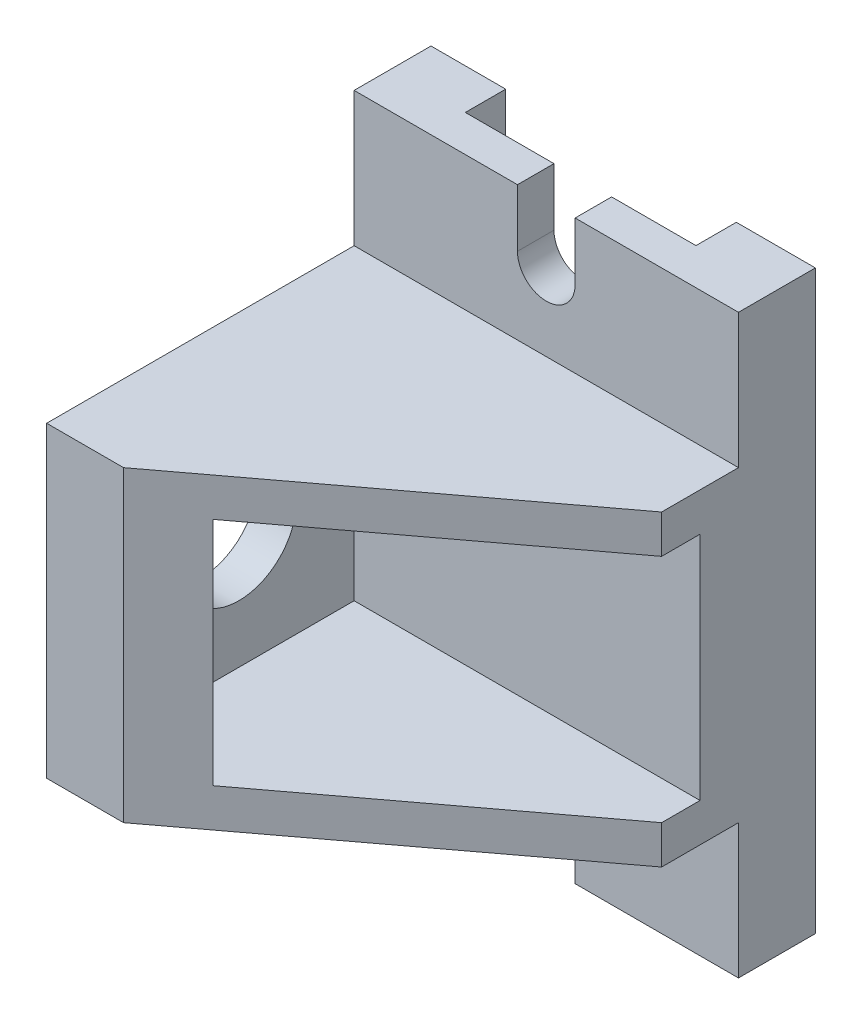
ISO-10303-21;
HEADER;
FILE_DESCRIPTION(('STEP AP214'),'2;1');
FILE_NAME('part.step','',(''),(''),'','','');
FILE_SCHEMA(('AUTOMOTIVE_DESIGN { 1 0 10303 214 1 1 1 1 }'));
ENDSEC;
DATA;
#1=APPLICATION_CONTEXT('core data for automotive mechanical design processes');
#2=APPLICATION_PROTOCOL_DEFINITION('international standard','automotive_design',2000,#1);
#3=PRODUCT_CONTEXT('',#1,'mechanical');
#4=PRODUCT('Part','Part','',(#3));
#5=PRODUCT_RELATED_PRODUCT_CATEGORY('part','',(#4));
#6=PRODUCT_DEFINITION_FORMATION('','',#4);
#7=PRODUCT_DEFINITION_CONTEXT('part definition',#1,'design');
#8=PRODUCT_DEFINITION('design','',#6,#7);
#9=PRODUCT_DEFINITION_SHAPE('','',#8);
#10=(LENGTH_UNIT() NAMED_UNIT(*) SI_UNIT(.MILLI.,.METRE.));
#11=(NAMED_UNIT(*) PLANE_ANGLE_UNIT() SI_UNIT($,.RADIAN.));
#12=(NAMED_UNIT(*) SI_UNIT($,.STERADIAN.) SOLID_ANGLE_UNIT());
#13=UNCERTAINTY_MEASURE_WITH_UNIT(LENGTH_MEASURE(1.E-05),#10,'distance_accuracy_value','');
#14=(GEOMETRIC_REPRESENTATION_CONTEXT(3) GLOBAL_UNCERTAINTY_ASSIGNED_CONTEXT((#13)) GLOBAL_UNIT_ASSIGNED_CONTEXT((#10,
#11,#12)) REPRESENTATION_CONTEXT('',''));
#15=CARTESIAN_POINT('',(0.,0.,0.));
#16=DIRECTION('',(0.,0.,1.));
#17=DIRECTION('',(1.,0.,0.));
#18=AXIS2_PLACEMENT_3D('',#15,#16,#17);
#19=CARTESIAN_POINT('',(50.,75.,10.));
#20=DIRECTION('',(-1.,0.,0.));
#21=DIRECTION('',(0.,-1.,0.));
#22=AXIS2_PLACEMENT_3D('',#19,#20,#21);
#23=PLANE('',#22);
#24=DIRECTION('',(0.,0.,1.));
#25=VECTOR('',#24,1.);
#26=CARTESIAN_POINT('',(50.,30.,80.));
#27=LINE('',#26,#25);
#28=CARTESIAN_POINT('',(50.,30.,20.));
#29=VERTEX_POINT('',#28);
#30=CARTESIAN_POINT('',(50.,30.,30.));
#31=VERTEX_POINT('',#30);
#32=EDGE_CURVE('E244',#29,#31,#27,.T.);
#33=ORIENTED_EDGE('',*,*,#32,.F.);
#34=DIRECTION('',(0.,1.,0.));
#35=VECTOR('',#34,1.);
#36=CARTESIAN_POINT('',(50.,30.,20.));
#37=LINE('',#36,#35);
#38=CARTESIAN_POINT('',(50.,-30.,20.));
#39=VERTEX_POINT('',#38);
#40=EDGE_CURVE('E219',#39,#29,#37,.T.);
#41=ORIENTED_EDGE('',*,*,#40,.F.);
#42=DIRECTION('',(0.,0.,-1.));
#43=VECTOR('',#42,1.);
#44=CARTESIAN_POINT('',(50.,-30.,80.));
#45=LINE('',#44,#43);
#46=CARTESIAN_POINT('',(50.,-30.,30.));
#47=VERTEX_POINT('',#46);
#48=EDGE_CURVE('E246',#47,#39,#45,.T.);
#49=ORIENTED_EDGE('',*,*,#48,.F.);
#50=DIRECTION('',(0.,-1.,0.));
#51=VECTOR('',#50,1.);
#52=CARTESIAN_POINT('',(50.,75.,30.));
#53=LINE('',#52,#51);
#54=CARTESIAN_POINT('',(50.,-40.,30.));
#55=VERTEX_POINT('',#54);
#56=EDGE_CURVE('E254',#47,#55,#53,.T.);
#57=ORIENTED_EDGE('',*,*,#56,.T.);
#58=DIRECTION('',(0.,0.,-1.));
#59=VECTOR('',#58,1.);
#60=CARTESIAN_POINT('',(50.,-40.,90.));
#61=LINE('',#60,#59);
#62=CARTESIAN_POINT('',(50.,-40.,10.));
#63=VERTEX_POINT('',#62);
#64=EDGE_CURVE('E268',#55,#63,#61,.T.);
#65=ORIENTED_EDGE('',*,*,#64,.T.);
#66=DIRECTION('',(0.,1.,0.));
#67=VECTOR('',#66,1.);
#68=CARTESIAN_POINT('',(50.,75.,10.));
#69=LINE('',#68,#67);
#70=CARTESIAN_POINT('',(50.,-75.,10.));
#71=VERTEX_POINT('',#70);
#72=EDGE_CURVE('E342',#71,#63,#69,.T.);
#73=ORIENTED_EDGE('',*,*,#72,.F.);
#74=DIRECTION('',(0.,0.,-1.));
#75=VECTOR('',#74,1.);
#76=CARTESIAN_POINT('',(50.,-75.,10.));
#77=LINE('',#76,#75);
#78=CARTESIAN_POINT('',(50.,-75.,-10.));
#79=VERTEX_POINT('',#78);
#80=EDGE_CURVE('E357',#71,#79,#77,.T.);
#81=ORIENTED_EDGE('',*,*,#80,.T.);
#82=DIRECTION('',(0.,1.,0.));
#83=VECTOR('',#82,1.);
#84=CARTESIAN_POINT('',(50.,75.,-10.));
#85=LINE('',#84,#83);
#86=CARTESIAN_POINT('',(50.,75.,-10.));
#87=VERTEX_POINT('',#86);
#88=EDGE_CURVE('E339',#79,#87,#85,.T.);
#89=ORIENTED_EDGE('',*,*,#88,.T.);
#90=DIRECTION('',(0.,0.,-1.));
#91=VECTOR('',#90,1.);
#92=CARTESIAN_POINT('',(50.,75.,10.));
#93=LINE('',#92,#91);
#94=CARTESIAN_POINT('',(50.,75.,10.));
#95=VERTEX_POINT('',#94);
#96=EDGE_CURVE('E378',#95,#87,#93,.T.);
#97=ORIENTED_EDGE('',*,*,#96,.F.);
#98=CARTESIAN_POINT('',(50.,40.,10.));
#99=VERTEX_POINT('',#98);
#100=EDGE_CURVE('E346',#99,#95,#69,.T.);
#101=ORIENTED_EDGE('',*,*,#100,.F.);
#102=DIRECTION('',(0.,0.,-1.));
#103=VECTOR('',#102,1.);
#104=CARTESIAN_POINT('',(50.,40.,90.));
#105=LINE('',#104,#103);
#106=CARTESIAN_POINT('',(50.,40.,30.));
#107=VERTEX_POINT('',#106);
#108=EDGE_CURVE('E280',#107,#99,#105,.T.);
#109=ORIENTED_EDGE('',*,*,#108,.F.);
#110=EDGE_CURVE('E255',#107,#31,#53,.T.);
#111=ORIENTED_EDGE('',*,*,#110,.T.);
#112=EDGE_LOOP('',(#33,#41,#49,#57,#65,#73,#81,#89,#97,#101,#109,#111));
#113=FACE_BOUND('',#112,.T.);
#114=ADVANCED_FACE('F39',(#113),#23,.F.);
#115=CARTESIAN_POINT('',(-30.,75.,90.));
#116=DIRECTION('',(-0.6,0.,-0.8));
#117=DIRECTION('',(-0.8,0.,0.6));
#118=AXIS2_PLACEMENT_3D('',#115,#116,#117);
#119=PLANE('',#118);
#120=DIRECTION('',(-0.8,0.,0.6));
#121=VECTOR('',#120,1.);
#122=CARTESIAN_POINT('',(-30.,30.,90.));
#123=LINE('',#122,#121);
#124=CARTESIAN_POINT('',(-16.6666666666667,30.,80.));
#125=VERTEX_POINT('',#124);
#126=EDGE_CURVE('E11',#31,#125,#123,.T.);
#127=ORIENTED_EDGE('',*,*,#126,.F.);
#128=ORIENTED_EDGE('',*,*,#110,.F.);
#129=DIRECTION('',(0.8,0.,-0.6));
#130=VECTOR('',#129,1.);
#131=CARTESIAN_POINT('',(-42.8,40.,99.6));
#132=LINE('',#131,#130);
#133=CARTESIAN_POINT('',(-30.,40.,90.));
#134=VERTEX_POINT('',#133);
#135=EDGE_CURVE('E62',#134,#107,#132,.T.);
#136=ORIENTED_EDGE('',*,*,#135,.F.);
#137=DIRECTION('',(0.,-1.,0.));
#138=VECTOR('',#137,1.);
#139=CARTESIAN_POINT('',(-30.,0.,90.));
#140=LINE('',#139,#138);
#141=CARTESIAN_POINT('',(-30.,-40.,90.));
#142=VERTEX_POINT('',#141);
#143=EDGE_CURVE('E402',#134,#142,#140,.T.);
#144=ORIENTED_EDGE('',*,*,#143,.T.);
#145=DIRECTION('',(0.8,0.,-0.6));
#146=VECTOR('',#145,1.);
#147=CARTESIAN_POINT('',(-30.,-40.,90.));
#148=LINE('',#147,#146);
#149=EDGE_CURVE('E222',#142,#55,#148,.T.);
#150=ORIENTED_EDGE('',*,*,#149,.T.);
#151=ORIENTED_EDGE('',*,*,#56,.F.);
#152=DIRECTION('',(0.8,0.,-0.6));
#153=VECTOR('',#152,1.);
#154=CARTESIAN_POINT('',(-30.,-30.,90.));
#155=LINE('',#154,#153);
#156=CARTESIAN_POINT('',(-16.6666666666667,-30.,80.));
#157=VERTEX_POINT('',#156);
#158=EDGE_CURVE('E404',#157,#47,#155,.T.);
#159=ORIENTED_EDGE('',*,*,#158,.F.);
#160=DIRECTION('',(0.,-1.,0.));
#161=VECTOR('',#160,1.);
#162=CARTESIAN_POINT('',(-16.6666666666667,75.,80.));
#163=LINE('',#162,#161);
#164=EDGE_CURVE('E47',#125,#157,#163,.T.);
#165=ORIENTED_EDGE('',*,*,#164,.F.);
#166=EDGE_LOOP('',(#127,#128,#136,#144,#150,#151,#159,#165));
#167=FACE_BOUND('',#166,.T.);
#168=ADVANCED_FACE('F412',(#167),#119,.F.);
#169=CARTESIAN_POINT('',(0.,0.,10.));
#170=DIRECTION('',(0.,0.,1.));
#171=DIRECTION('',(1.,0.,0.));
#172=AXIS2_PLACEMENT_3D('',#169,#170,#171);
#173=PLANE('',#172);
#174=DIRECTION('',(1.,0.,0.));
#175=VECTOR('',#174,1.);
#176=CARTESIAN_POINT('',(-50.,-40.,10.));
#177=LINE('',#176,#175);
#178=CARTESIAN_POINT('',(-50.,-40.,10.));
#179=VERTEX_POINT('',#178);
#180=EDGE_CURVE('E263',#179,#63,#177,.T.);
#181=ORIENTED_EDGE('',*,*,#180,.F.);
#182=DIRECTION('',(0.,-1.,0.));
#183=VECTOR('',#182,1.);
#184=CARTESIAN_POINT('',(-50.,75.,10.));
#185=LINE('',#184,#183);
#186=CARTESIAN_POINT('',(-50.,-75.,10.));
#187=VERTEX_POINT('',#186);
#188=EDGE_CURVE('E350',#179,#187,#185,.T.);
#189=ORIENTED_EDGE('',*,*,#188,.T.);
#190=DIRECTION('',(1.,0.,0.));
#191=VECTOR('',#190,1.);
#192=CARTESIAN_POINT('',(-50.,-75.,10.));
#193=LINE('',#192,#191);
#194=CARTESIAN_POINT('',(-7.5,-75.,10.));
#195=VERTEX_POINT('',#194);
#196=EDGE_CURVE('E354',#187,#195,#193,.T.);
#197=ORIENTED_EDGE('',*,*,#196,.T.);
#198=DIRECTION('',(0.,-1.,0.));
#199=VECTOR('',#198,1.);
#200=CARTESIAN_POINT('',(-7.5,-60.,10.));
#201=LINE('',#200,#199);
#202=CARTESIAN_POINT('',(-7.5,-60.,10.));
#203=VERTEX_POINT('',#202);
#204=EDGE_CURVE('E303',#203,#195,#201,.T.);
#205=ORIENTED_EDGE('',*,*,#204,.F.);
#206=CARTESIAN_POINT('',(0.,-60.,10.));
#207=DIRECTION('',(0.,0.,1.));
#208=DIRECTION('',(1.,0.,0.));
#209=AXIS2_PLACEMENT_3D('',#206,#207,#208);
#210=CIRCLE('',#209,7.5);
#211=CARTESIAN_POINT('',(7.5,-60.,10.));
#212=VERTEX_POINT('',#211);
#213=EDGE_CURVE('E294',#212,#203,#210,.T.);
#214=ORIENTED_EDGE('',*,*,#213,.F.);
#215=DIRECTION('',(0.,1.,0.));
#216=VECTOR('',#215,1.);
#217=CARTESIAN_POINT('',(7.5,-75.,10.));
#218=LINE('',#217,#216);
#219=CARTESIAN_POINT('',(7.5,-75.,10.));
#220=VERTEX_POINT('',#219);
#221=EDGE_CURVE('E305',#220,#212,#218,.T.);
#222=ORIENTED_EDGE('',*,*,#221,.F.);
#223=EDGE_CURVE('E353',#220,#71,#193,.T.);
#224=ORIENTED_EDGE('',*,*,#223,.T.);
#225=ORIENTED_EDGE('',*,*,#72,.T.);
#226=EDGE_LOOP('',(#181,#189,#197,#205,#214,#222,#224,#225));
#227=FACE_BOUND('',#226,.T.);
#228=ADVANCED_FACE('F468',(#227),#173,.T.);
#229=CARTESIAN_POINT('',(-50.,75.,10.));
#230=DIRECTION('',(0.,-1.,0.));
#231=DIRECTION('',(0.,0.,-1.));
#232=AXIS2_PLACEMENT_3D('',#229,#230,#231);
#233=PLANE('',#232);
#234=DIRECTION('',(0.,0.,1.));
#235=VECTOR('',#234,1.);
#236=CARTESIAN_POINT('',(-7.5,75.,-10.));
#237=LINE('',#236,#235);
#238=CARTESIAN_POINT('',(-7.5,75.,0.504477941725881));
#239=VERTEX_POINT('',#238);
#240=CARTESIAN_POINT('',(-7.5,75.,10.));
#241=VERTEX_POINT('',#240);
#242=EDGE_CURVE('E295',#239,#241,#237,.T.);
#243=ORIENTED_EDGE('',*,*,#242,.F.);
#244=DIRECTION('',(-1.,0.,0.));
#245=VECTOR('',#244,1.);
#246=CARTESIAN_POINT('',(-30.5599962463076,75.,0.504477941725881));
#247=LINE('',#246,#245);
#248=CARTESIAN_POINT('',(-30.5599962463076,75.,0.504477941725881));
#249=VERTEX_POINT('',#248);
#250=EDGE_CURVE('E321',#239,#249,#247,.T.);
#251=ORIENTED_EDGE('',*,*,#250,.T.);
#252=DIRECTION('',(0.,0.,-1.));
#253=VECTOR('',#252,1.);
#254=CARTESIAN_POINT('',(-30.5599962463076,75.,0.504477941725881));
#255=LINE('',#254,#253);
#256=CARTESIAN_POINT('',(-30.5599962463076,75.,-10.));
#257=VERTEX_POINT('',#256);
#258=EDGE_CURVE('E326',#249,#257,#255,.T.);
#259=ORIENTED_EDGE('',*,*,#258,.T.);
#260=DIRECTION('',(-1.,0.,0.));
#261=VECTOR('',#260,1.);
#262=CARTESIAN_POINT('',(-50.,75.,-10.));
#263=LINE('',#262,#261);
#264=CARTESIAN_POINT('',(-50.,75.,-10.));
#265=VERTEX_POINT('',#264);
#266=EDGE_CURVE('E360',#257,#265,#263,.T.);
#267=ORIENTED_EDGE('',*,*,#266,.T.);
#268=DIRECTION('',(0.,0.,-1.));
#269=VECTOR('',#268,1.);
#270=CARTESIAN_POINT('',(-50.,75.,10.));
#271=LINE('',#270,#269);
#272=CARTESIAN_POINT('',(-50.,75.,10.));
#273=VERTEX_POINT('',#272);
#274=EDGE_CURVE('E375',#273,#265,#271,.T.);
#275=ORIENTED_EDGE('',*,*,#274,.F.);
#276=DIRECTION('',(-1.,0.,0.));
#277=VECTOR('',#276,1.);
#278=CARTESIAN_POINT('',(-50.,75.,10.));
#279=LINE('',#278,#277);
#280=EDGE_CURVE('E345',#241,#273,#279,.T.);
#281=ORIENTED_EDGE('',*,*,#280,.F.);
#282=EDGE_LOOP('',(#243,#251,#259,#267,#275,#281));
#283=FACE_BOUND('',#282,.T.);
#284=ADVANCED_FACE('F450',(#283),#233,.F.);
#285=DIRECTION('',(0.,0.,1.));
#286=VECTOR('',#285,1.);
#287=CARTESIAN_POINT('',(7.5,75.,-10.));
#288=LINE('',#287,#286);
#289=CARTESIAN_POINT('',(7.5,75.,0.504477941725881));
#290=VERTEX_POINT('',#289);
#291=CARTESIAN_POINT('',(7.5,75.,10.));
#292=VERTEX_POINT('',#291);
#293=EDGE_CURVE('E297',#290,#292,#288,.T.);
#294=ORIENTED_EDGE('',*,*,#293,.T.);
#295=EDGE_CURVE('E347',#95,#292,#279,.T.);
#296=ORIENTED_EDGE('',*,*,#295,.F.);
#297=ORIENTED_EDGE('',*,*,#96,.T.);
#298=CARTESIAN_POINT('',(29.4400037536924,75.,-10.));
#299=VERTEX_POINT('',#298);
#300=EDGE_CURVE('E361',#87,#299,#263,.T.);
#301=ORIENTED_EDGE('',*,*,#300,.T.);
#302=DIRECTION('',(0.,0.,1.));
#303=VECTOR('',#302,1.);
#304=CARTESIAN_POINT('',(29.4400037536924,75.,0.504477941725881));
#305=LINE('',#304,#303);
#306=CARTESIAN_POINT('',(29.4400037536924,75.,0.504477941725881));
#307=VERTEX_POINT('',#306);
#308=EDGE_CURVE('E318',#299,#307,#305,.T.);
#309=ORIENTED_EDGE('',*,*,#308,.T.);
#310=EDGE_CURVE('E323',#307,#290,#247,.T.);
#311=ORIENTED_EDGE('',*,*,#310,.T.);
#312=EDGE_LOOP('',(#294,#296,#297,#301,#309,#311));
#313=FACE_BOUND('',#312,.T.);
#314=ADVANCED_FACE('F428',(#313),#233,.F.);
#315=DIRECTION('',(-1.,0.,0.));
#316=VECTOR('',#315,1.);
#317=CARTESIAN_POINT('',(-50.,40.,10.));
#318=LINE('',#317,#316);
#319=CARTESIAN_POINT('',(-50.,40.,10.));
#320=VERTEX_POINT('',#319);
#321=EDGE_CURVE('E259',#99,#320,#318,.T.);
#322=ORIENTED_EDGE('',*,*,#321,.F.);
#323=ORIENTED_EDGE('',*,*,#100,.T.);
#324=ORIENTED_EDGE('',*,*,#295,.T.);
#325=DIRECTION('',(0.,-1.,0.));
#326=VECTOR('',#325,1.);
#327=CARTESIAN_POINT('',(7.5,75.,10.));
#328=LINE('',#327,#326);
#329=CARTESIAN_POINT('',(7.5,60.,10.));
#330=VERTEX_POINT('',#329);
#331=EDGE_CURVE('E285',#292,#330,#328,.T.);
#332=ORIENTED_EDGE('',*,*,#331,.T.);
#333=CARTESIAN_POINT('',(0.,60.,10.));
#334=DIRECTION('',(0.,0.,-1.));
#335=DIRECTION('',(1.,0.,0.));
#336=AXIS2_PLACEMENT_3D('',#333,#334,#335);
#337=CIRCLE('',#336,7.5);
#338=CARTESIAN_POINT('',(-7.5,60.,10.));
#339=VERTEX_POINT('',#338);
#340=EDGE_CURVE('E282',#330,#339,#337,.T.);
#341=ORIENTED_EDGE('',*,*,#340,.T.);
#342=DIRECTION('',(0.,1.,0.));
#343=VECTOR('',#342,1.);
#344=CARTESIAN_POINT('',(-7.5,60.,10.));
#345=LINE('',#344,#343);
#346=EDGE_CURVE('E288',#339,#241,#345,.T.);
#347=ORIENTED_EDGE('',*,*,#346,.T.);
#348=ORIENTED_EDGE('',*,*,#280,.T.);
#349=EDGE_CURVE('E351',#273,#320,#185,.T.);
#350=ORIENTED_EDGE('',*,*,#349,.T.);
#351=EDGE_LOOP('',(#322,#323,#324,#332,#341,#347,#348,#350));
#352=FACE_BOUND('',#351,.T.);
#353=ADVANCED_FACE('F426',(#352),#173,.T.);
#354=CARTESIAN_POINT('',(-30.5599962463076,75.,0.504477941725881));
#355=DIRECTION('',(0.,0.,1.));
#356=DIRECTION('',(1.,0.,0.));
#357=AXIS2_PLACEMENT_3D('',#354,#355,#356);
#358=PLANE('',#357);
#359=DIRECTION('',(0.,1.,0.));
#360=VECTOR('',#359,1.);
#361=CARTESIAN_POINT('',(-7.5,75.,0.504477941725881));
#362=LINE('',#361,#360);
#363=CARTESIAN_POINT('',(-7.5,60.,0.504477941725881));
#364=VERTEX_POINT('',#363);
#365=EDGE_CURVE('E400',#364,#239,#362,.T.);
#366=ORIENTED_EDGE('',*,*,#365,.F.);
#367=CARTESIAN_POINT('',(0.,60.,0.504477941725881));
#368=DIRECTION('',(0.,0.,1.));
#369=DIRECTION('',(1.,0.,0.));
#370=AXIS2_PLACEMENT_3D('',#367,#368,#369);
#371=CIRCLE('',#370,7.5);
#372=CARTESIAN_POINT('',(7.5,60.,0.504477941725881));
#373=VERTEX_POINT('',#372);
#374=EDGE_CURVE('E398',#373,#364,#371,.F.);
#375=ORIENTED_EDGE('',*,*,#374,.F.);
#376=DIRECTION('',(0.,-1.,0.));
#377=VECTOR('',#376,1.);
#378=CARTESIAN_POINT('',(7.5,75.,0.504477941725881));
#379=LINE('',#378,#377);
#380=EDGE_CURVE('E396',#290,#373,#379,.T.);
#381=ORIENTED_EDGE('',*,*,#380,.F.);
#382=ORIENTED_EDGE('',*,*,#310,.F.);
#383=DIRECTION('',(0.,-1.,0.));
#384=VECTOR('',#383,1.);
#385=CARTESIAN_POINT('',(29.4400037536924,75.,0.504477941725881));
#386=LINE('',#385,#384);
#387=CARTESIAN_POINT('',(29.4400037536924,-75.,0.504477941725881));
#388=VERTEX_POINT('',#387);
#389=EDGE_CURVE('E329',#307,#388,#386,.T.);
#390=ORIENTED_EDGE('',*,*,#389,.T.);
#391=DIRECTION('',(-1.,0.,0.));
#392=VECTOR('',#391,1.);
#393=CARTESIAN_POINT('',(-30.5599962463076,-75.,0.504477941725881));
#394=LINE('',#393,#392);
#395=CARTESIAN_POINT('',(7.5,-75.,0.504477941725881));
#396=VERTEX_POINT('',#395);
#397=EDGE_CURVE('E332',#388,#396,#394,.T.);
#398=ORIENTED_EDGE('',*,*,#397,.T.);
#399=DIRECTION('',(0.,1.,0.));
#400=VECTOR('',#399,1.);
#401=CARTESIAN_POINT('',(7.5,75.,0.504477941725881));
#402=LINE('',#401,#400);
#403=CARTESIAN_POINT('',(7.5,-60.,0.504477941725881));
#404=VERTEX_POINT('',#403);
#405=EDGE_CURVE('E393',#396,#404,#402,.T.);
#406=ORIENTED_EDGE('',*,*,#405,.T.);
#407=CARTESIAN_POINT('',(0.,-60.,0.504477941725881));
#408=DIRECTION('',(0.,0.,1.));
#409=DIRECTION('',(1.,0.,0.));
#410=AXIS2_PLACEMENT_3D('',#407,#408,#409);
#411=CIRCLE('',#410,7.5);
#412=CARTESIAN_POINT('',(-7.5,-60.,0.504477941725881));
#413=VERTEX_POINT('',#412);
#414=EDGE_CURVE('E390',#404,#413,#411,.T.);
#415=ORIENTED_EDGE('',*,*,#414,.T.);
#416=DIRECTION('',(0.,-1.,0.));
#417=VECTOR('',#416,1.);
#418=CARTESIAN_POINT('',(-7.5,75.,0.504477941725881));
#419=LINE('',#418,#417);
#420=CARTESIAN_POINT('',(-7.5,-75.,0.504477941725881));
#421=VERTEX_POINT('',#420);
#422=EDGE_CURVE('E387',#413,#421,#419,.T.);
#423=ORIENTED_EDGE('',*,*,#422,.T.);
#424=CARTESIAN_POINT('',(-30.5599962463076,-75.,0.504477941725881));
#425=VERTEX_POINT('',#424);
#426=EDGE_CURVE('E331',#421,#425,#394,.T.);
#427=ORIENTED_EDGE('',*,*,#426,.T.);
#428=DIRECTION('',(0.,-1.,0.));
#429=VECTOR('',#428,1.);
#430=CARTESIAN_POINT('',(-30.5599962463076,75.,0.504477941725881));
#431=LINE('',#430,#429);
#432=EDGE_CURVE('E336',#249,#425,#431,.T.);
#433=ORIENTED_EDGE('',*,*,#432,.F.);
#434=ORIENTED_EDGE('',*,*,#250,.F.);
#435=EDGE_LOOP('',(#366,#375,#381,#382,#390,#398,#406,#415,#423,#427,#433,#434));
#436=FACE_BOUND('',#435,.T.);
#437=ADVANCED_FACE('F437',(#436),#358,.F.);
#438=CARTESIAN_POINT('',(-50.,-75.,10.));
#439=DIRECTION('',(0.,1.,0.));
#440=DIRECTION('',(0.,0.,1.));
#441=AXIS2_PLACEMENT_3D('',#438,#439,#440);
#442=PLANE('',#441);
#443=ORIENTED_EDGE('',*,*,#223,.F.);
#444=DIRECTION('',(0.,0.,1.));
#445=VECTOR('',#444,1.);
#446=CARTESIAN_POINT('',(7.5,-75.,-10.));
#447=LINE('',#446,#445);
#448=EDGE_CURVE('E312',#396,#220,#447,.T.);
#449=ORIENTED_EDGE('',*,*,#448,.F.);
#450=ORIENTED_EDGE('',*,*,#397,.F.);
#451=DIRECTION('',(0.,0.,1.));
#452=VECTOR('',#451,1.);
#453=CARTESIAN_POINT('',(29.4400037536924,-75.,0.504477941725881));
#454=LINE('',#453,#452);
#455=CARTESIAN_POINT('',(29.4400037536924,-75.,-10.));
#456=VERTEX_POINT('',#455);
#457=EDGE_CURVE('E311',#456,#388,#454,.T.);
#458=ORIENTED_EDGE('',*,*,#457,.F.);
#459=DIRECTION('',(1.,0.,0.));
#460=VECTOR('',#459,1.);
#461=CARTESIAN_POINT('',(-50.,-75.,-10.));
#462=LINE('',#461,#460);
#463=EDGE_CURVE('E366',#456,#79,#462,.T.);
#464=ORIENTED_EDGE('',*,*,#463,.T.);
#465=ORIENTED_EDGE('',*,*,#80,.F.);
#466=EDGE_LOOP('',(#443,#449,#450,#458,#464,#465));
#467=FACE_BOUND('',#466,.T.);
#468=ADVANCED_FACE('F475',(#467),#442,.F.);
#469=CARTESIAN_POINT('',(0.,0.,-10.));
#470=DIRECTION('',(0.,0.,1.));
#471=DIRECTION('',(1.,0.,0.));
#472=AXIS2_PLACEMENT_3D('',#469,#470,#471);
#473=PLANE('',#472);
#474=ORIENTED_EDGE('',*,*,#463,.F.);
#475=DIRECTION('',(0.,1.,0.));
#476=VECTOR('',#475,1.);
#477=CARTESIAN_POINT('',(29.4400037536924,0.,-10.));
#478=LINE('',#477,#476);
#479=EDGE_CURVE('E384',#456,#299,#478,.T.);
#480=ORIENTED_EDGE('',*,*,#479,.T.);
#481=ORIENTED_EDGE('',*,*,#300,.F.);
#482=ORIENTED_EDGE('',*,*,#88,.F.);
#483=EDGE_LOOP('',(#474,#480,#481,#482));
#484=FACE_BOUND('',#483,.T.);
#485=ADVANCED_FACE('F480',(#484),#473,.F.);
#486=CARTESIAN_POINT('',(-50.,75.,10.));
#487=DIRECTION('',(1.,0.,0.));
#488=DIRECTION('',(0.,1.,0.));
#489=AXIS2_PLACEMENT_3D('',#486,#487,#488);
#490=PLANE('',#489);
#491=CARTESIAN_POINT('',(-50.,0.,50.));
#492=DIRECTION('',(1.,0.,0.));
#493=DIRECTION('',(0.,1.,0.));
#494=AXIS2_PLACEMENT_3D('',#491,#492,#493);
#495=CIRCLE('',#494,15.);
#496=CARTESIAN_POINT('',(-50.,15.,50.));
#497=VERTEX_POINT('',#496);
#498=EDGE_CURVE('E42',#497,#497,#495,.T.);
#499=ORIENTED_EDGE('',*,*,#498,.T.);
#500=EDGE_LOOP('',(#499));
#501=FACE_BOUND('',#500,.T.);
#502=DIRECTION('',(0.,-1.,0.));
#503=VECTOR('',#502,1.);
#504=CARTESIAN_POINT('',(-50.,75.,-10.));
#505=LINE('',#504,#503);
#506=CARTESIAN_POINT('',(-50.,-75.,-10.));
#507=VERTEX_POINT('',#506);
#508=EDGE_CURVE('E364',#265,#507,#505,.T.);
#509=ORIENTED_EDGE('',*,*,#508,.T.);
#510=DIRECTION('',(0.,0.,-1.));
#511=VECTOR('',#510,1.);
#512=CARTESIAN_POINT('',(-50.,-75.,10.));
#513=LINE('',#512,#511);
#514=EDGE_CURVE('E372',#187,#507,#513,.T.);
#515=ORIENTED_EDGE('',*,*,#514,.F.);
#516=ORIENTED_EDGE('',*,*,#188,.F.);
#517=DIRECTION('',(0.,0.,-1.));
#518=VECTOR('',#517,1.);
#519=CARTESIAN_POINT('',(-50.,-40.,90.));
#520=LINE('',#519,#518);
#521=CARTESIAN_POINT('',(-50.,-40.,90.));
#522=VERTEX_POINT('',#521);
#523=EDGE_CURVE('E274',#522,#179,#520,.T.);
#524=ORIENTED_EDGE('',*,*,#523,.F.);
#525=DIRECTION('',(0.,-1.,0.));
#526=VECTOR('',#525,1.);
#527=CARTESIAN_POINT('',(-50.,40.,90.));
#528=LINE('',#527,#526);
#529=CARTESIAN_POINT('',(-50.,40.,90.));
#530=VERTEX_POINT('',#529);
#531=EDGE_CURVE('E262',#530,#522,#528,.T.);
#532=ORIENTED_EDGE('',*,*,#531,.F.);
#533=DIRECTION('',(0.,0.,-1.));
#534=VECTOR('',#533,1.);
#535=CARTESIAN_POINT('',(-50.,40.,90.));
#536=LINE('',#535,#534);
#537=EDGE_CURVE('E277',#530,#320,#536,.T.);
#538=ORIENTED_EDGE('',*,*,#537,.T.);
#539=ORIENTED_EDGE('',*,*,#349,.F.);
#540=ORIENTED_EDGE('',*,*,#274,.T.);
#541=EDGE_LOOP('',(#509,#515,#516,#524,#532,#538,#539,#540));
#542=FACE_BOUND('',#541,.T.);
#543=ADVANCED_FACE('F455',(#501,#542),#490,.F.);
#544=ORIENTED_EDGE('',*,*,#426,.F.);
#545=DIRECTION('',(0.,0.,1.));
#546=VECTOR('',#545,1.);
#547=CARTESIAN_POINT('',(-7.5,-75.,-10.));
#548=LINE('',#547,#546);
#549=EDGE_CURVE('E314',#421,#195,#548,.T.);
#550=ORIENTED_EDGE('',*,*,#549,.T.);
#551=ORIENTED_EDGE('',*,*,#196,.F.);
#552=ORIENTED_EDGE('',*,*,#514,.T.);
#553=CARTESIAN_POINT('',(-30.5599962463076,-75.,-10.));
#554=VERTEX_POINT('',#553);
#555=EDGE_CURVE('E367',#507,#554,#462,.T.);
#556=ORIENTED_EDGE('',*,*,#555,.T.);
#557=DIRECTION('',(0.,0.,-1.));
#558=VECTOR('',#557,1.);
#559=CARTESIAN_POINT('',(-30.5599962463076,-75.,0.504477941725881));
#560=LINE('',#559,#558);
#561=EDGE_CURVE('E322',#425,#554,#560,.T.);
#562=ORIENTED_EDGE('',*,*,#561,.F.);
#563=EDGE_LOOP('',(#544,#550,#551,#552,#556,#562));
#564=FACE_BOUND('',#563,.T.);
#565=ADVANCED_FACE('F496',(#564),#442,.F.);
#566=ORIENTED_EDGE('',*,*,#266,.F.);
#567=DIRECTION('',(0.,-1.,0.));
#568=VECTOR('',#567,1.);
#569=CARTESIAN_POINT('',(-30.5599962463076,0.,-10.));
#570=LINE('',#569,#568);
#571=EDGE_CURVE('E381',#257,#554,#570,.T.);
#572=ORIENTED_EDGE('',*,*,#571,.T.);
#573=ORIENTED_EDGE('',*,*,#555,.F.);
#574=ORIENTED_EDGE('',*,*,#508,.F.);
#575=EDGE_LOOP('',(#566,#572,#573,#574));
#576=FACE_BOUND('',#575,.T.);
#577=ADVANCED_FACE('F501',(#576),#473,.F.);
#578=CARTESIAN_POINT('',(29.4400037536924,75.,0.504477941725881));
#579=DIRECTION('',(1.,0.,0.));
#580=DIRECTION('',(0.,0.,-1.));
#581=AXIS2_PLACEMENT_3D('',#578,#579,#580);
#582=PLANE('',#581);
#583=ORIENTED_EDGE('',*,*,#457,.T.);
#584=ORIENTED_EDGE('',*,*,#389,.F.);
#585=ORIENTED_EDGE('',*,*,#308,.F.);
#586=ORIENTED_EDGE('',*,*,#479,.F.);
#587=EDGE_LOOP('',(#583,#584,#585,#586));
#588=FACE_BOUND('',#587,.T.);
#589=ADVANCED_FACE('F482',(#588),#582,.F.);
#590=CARTESIAN_POINT('',(-30.5599962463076,75.,0.504477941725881));
#591=DIRECTION('',(-1.,0.,0.));
#592=DIRECTION('',(0.,0.,1.));
#593=AXIS2_PLACEMENT_3D('',#590,#591,#592);
#594=PLANE('',#593);
#595=ORIENTED_EDGE('',*,*,#258,.F.);
#596=ORIENTED_EDGE('',*,*,#432,.T.);
#597=ORIENTED_EDGE('',*,*,#561,.T.);
#598=ORIENTED_EDGE('',*,*,#571,.F.);
#599=EDGE_LOOP('',(#595,#596,#597,#598));
#600=FACE_BOUND('',#599,.T.);
#601=ADVANCED_FACE('F504',(#600),#594,.F.);
#602=CARTESIAN_POINT('',(0.,-60.,-10.));
#603=DIRECTION('',(0.,0.,1.));
#604=DIRECTION('',(1.,0.,0.));
#605=AXIS2_PLACEMENT_3D('',#602,#603,#604);
#606=CYLINDRICAL_SURFACE('',#605,7.5);
#607=DIRECTION('',(0.,0.,1.));
#608=VECTOR('',#607,1.);
#609=CARTESIAN_POINT('',(7.5,-60.,-10.));
#610=LINE('',#609,#608);
#611=EDGE_CURVE('E309',#404,#212,#610,.T.);
#612=ORIENTED_EDGE('',*,*,#611,.T.);
#613=ORIENTED_EDGE('',*,*,#213,.T.);
#614=DIRECTION('',(0.,0.,1.));
#615=VECTOR('',#614,1.);
#616=CARTESIAN_POINT('',(-7.5,-60.,-10.));
#617=LINE('',#616,#615);
#618=EDGE_CURVE('E308',#413,#203,#617,.T.);
#619=ORIENTED_EDGE('',*,*,#618,.F.);
#620=ORIENTED_EDGE('',*,*,#414,.F.);
#621=EDGE_LOOP('',(#612,#613,#619,#620));
#622=FACE_BOUND('',#621,.T.);
#623=ADVANCED_FACE('F490',(#622),#606,.F.);
#624=CARTESIAN_POINT('',(7.5,-75.,-10.));
#625=DIRECTION('',(1.,0.,0.));
#626=DIRECTION('',(0.,0.,-1.));
#627=AXIS2_PLACEMENT_3D('',#624,#625,#626);
#628=PLANE('',#627);
#629=ORIENTED_EDGE('',*,*,#448,.T.);
#630=ORIENTED_EDGE('',*,*,#221,.T.);
#631=ORIENTED_EDGE('',*,*,#611,.F.);
#632=ORIENTED_EDGE('',*,*,#405,.F.);
#633=EDGE_LOOP('',(#629,#630,#631,#632));
#634=FACE_BOUND('',#633,.T.);
#635=ADVANCED_FACE('F485',(#634),#628,.F.);
#636=CARTESIAN_POINT('',(-7.5,-60.,-10.));
#637=DIRECTION('',(-1.,0.,0.));
#638=DIRECTION('',(0.,0.,1.));
#639=AXIS2_PLACEMENT_3D('',#636,#637,#638);
#640=PLANE('',#639);
#641=ORIENTED_EDGE('',*,*,#618,.T.);
#642=ORIENTED_EDGE('',*,*,#204,.T.);
#643=ORIENTED_EDGE('',*,*,#549,.F.);
#644=ORIENTED_EDGE('',*,*,#422,.F.);
#645=EDGE_LOOP('',(#641,#642,#643,#644));
#646=FACE_BOUND('',#645,.T.);
#647=ADVANCED_FACE('F493',(#646),#640,.F.);
#648=CARTESIAN_POINT('',(0.,60.,-10.));
#649=DIRECTION('',(0.,0.,1.));
#650=DIRECTION('',(1.,0.,0.));
#651=AXIS2_PLACEMENT_3D('',#648,#649,#650);
#652=CYLINDRICAL_SURFACE('',#651,7.5);
#653=ORIENTED_EDGE('',*,*,#374,.T.);
#654=DIRECTION('',(0.,0.,1.));
#655=VECTOR('',#654,1.);
#656=CARTESIAN_POINT('',(-7.5,60.,-10.));
#657=LINE('',#656,#655);
#658=EDGE_CURVE('E292',#364,#339,#657,.T.);
#659=ORIENTED_EDGE('',*,*,#658,.T.);
#660=ORIENTED_EDGE('',*,*,#340,.F.);
#661=DIRECTION('',(0.,0.,1.));
#662=VECTOR('',#661,1.);
#663=CARTESIAN_POINT('',(7.5,60.,-10.));
#664=LINE('',#663,#662);
#665=EDGE_CURVE('E291',#373,#330,#664,.T.);
#666=ORIENTED_EDGE('',*,*,#665,.F.);
#667=EDGE_LOOP('',(#653,#659,#660,#666));
#668=FACE_BOUND('',#667,.T.);
#669=ADVANCED_FACE('F441',(#668),#652,.F.);
#670=CARTESIAN_POINT('',(-7.5,60.,-10.));
#671=DIRECTION('',(1.,0.,0.));
#672=DIRECTION('',(0.,0.,-1.));
#673=AXIS2_PLACEMENT_3D('',#670,#671,#672);
#674=PLANE('',#673);
#675=ORIENTED_EDGE('',*,*,#365,.T.);
#676=ORIENTED_EDGE('',*,*,#242,.T.);
#677=ORIENTED_EDGE('',*,*,#346,.F.);
#678=ORIENTED_EDGE('',*,*,#658,.F.);
#679=EDGE_LOOP('',(#675,#676,#677,#678));
#680=FACE_BOUND('',#679,.T.);
#681=ADVANCED_FACE('F445',(#680),#674,.T.);
#682=CARTESIAN_POINT('',(7.5,75.,-10.));
#683=DIRECTION('',(-1.,0.,0.));
#684=DIRECTION('',(0.,0.,1.));
#685=AXIS2_PLACEMENT_3D('',#682,#683,#684);
#686=PLANE('',#685);
#687=ORIENTED_EDGE('',*,*,#380,.T.);
#688=ORIENTED_EDGE('',*,*,#665,.T.);
#689=ORIENTED_EDGE('',*,*,#331,.F.);
#690=ORIENTED_EDGE('',*,*,#293,.F.);
#691=EDGE_LOOP('',(#687,#688,#689,#690));
#692=FACE_BOUND('',#691,.T.);
#693=ADVANCED_FACE('F432',(#692),#686,.T.);
#694=CARTESIAN_POINT('',(-50.,40.,90.));
#695=DIRECTION('',(0.,-1.,0.));
#696=DIRECTION('',(0.,0.,-1.));
#697=AXIS2_PLACEMENT_3D('',#694,#695,#696);
#698=PLANE('',#697);
#699=DIRECTION('',(-1.,0.,0.));
#700=VECTOR('',#699,1.);
#701=CARTESIAN_POINT('',(-50.,40.,90.));
#702=LINE('',#701,#700);
#703=EDGE_CURVE('E260',#134,#530,#702,.T.);
#704=ORIENTED_EDGE('',*,*,#703,.F.);
#705=ORIENTED_EDGE('',*,*,#135,.T.);
#706=ORIENTED_EDGE('',*,*,#108,.T.);
#707=ORIENTED_EDGE('',*,*,#321,.T.);
#708=ORIENTED_EDGE('',*,*,#537,.F.);
#709=EDGE_LOOP('',(#704,#705,#706,#707,#708));
#710=FACE_BOUND('',#709,.T.);
#711=ADVANCED_FACE('F419',(#710),#698,.F.);
#712=CARTESIAN_POINT('',(-50.,-40.,90.));
#713=DIRECTION('',(0.,1.,0.));
#714=DIRECTION('',(0.,0.,1.));
#715=AXIS2_PLACEMENT_3D('',#712,#713,#714);
#716=PLANE('',#715);
#717=ORIENTED_EDGE('',*,*,#64,.F.);
#718=ORIENTED_EDGE('',*,*,#149,.F.);
#719=DIRECTION('',(1.,0.,0.));
#720=VECTOR('',#719,1.);
#721=CARTESIAN_POINT('',(-50.,-40.,90.));
#722=LINE('',#721,#720);
#723=EDGE_CURVE('E265',#522,#142,#722,.T.);
#724=ORIENTED_EDGE('',*,*,#723,.F.);
#725=ORIENTED_EDGE('',*,*,#523,.T.);
#726=ORIENTED_EDGE('',*,*,#180,.T.);
#727=EDGE_LOOP('',(#717,#718,#724,#725,#726));
#728=FACE_BOUND('',#727,.T.);
#729=ADVANCED_FACE('F465',(#728),#716,.F.);
#730=CARTESIAN_POINT('',(0.,0.,90.));
#731=DIRECTION('',(0.,0.,1.));
#732=DIRECTION('',(1.,0.,0.));
#733=AXIS2_PLACEMENT_3D('',#730,#731,#732);
#734=PLANE('',#733);
#735=ORIENTED_EDGE('',*,*,#143,.F.);
#736=ORIENTED_EDGE('',*,*,#703,.T.);
#737=ORIENTED_EDGE('',*,*,#531,.T.);
#738=ORIENTED_EDGE('',*,*,#723,.T.);
#739=EDGE_LOOP('',(#735,#736,#737,#738));
#740=FACE_BOUND('',#739,.T.);
#741=ADVANCED_FACE('F461',(#740),#734,.T.);
#742=CARTESIAN_POINT('',(50.,30.,80.));
#743=DIRECTION('',(0.,-1.,0.));
#744=DIRECTION('',(0.,0.,-1.));
#745=AXIS2_PLACEMENT_3D('',#742,#743,#744);
#746=PLANE('',#745);
#747=ORIENTED_EDGE('',*,*,#126,.T.);
#748=DIRECTION('',(-1.,0.,0.));
#749=VECTOR('',#748,1.);
#750=CARTESIAN_POINT('',(50.,30.,80.));
#751=LINE('',#750,#749);
#752=CARTESIAN_POINT('',(-40.,30.,80.));
#753=VERTEX_POINT('',#752);
#754=EDGE_CURVE('E223',#125,#753,#751,.T.);
#755=ORIENTED_EDGE('',*,*,#754,.T.);
#756=DIRECTION('',(0.,0.,1.));
#757=VECTOR('',#756,1.);
#758=CARTESIAN_POINT('',(-40.,30.,80.));
#759=LINE('',#758,#757);
#760=CARTESIAN_POINT('',(-40.,30.,20.));
#761=VERTEX_POINT('',#760);
#762=EDGE_CURVE('E226',#761,#753,#759,.T.);
#763=ORIENTED_EDGE('',*,*,#762,.F.);
#764=DIRECTION('',(-1.,0.,0.));
#765=VECTOR('',#764,1.);
#766=CARTESIAN_POINT('',(50.,30.,20.));
#767=LINE('',#766,#765);
#768=EDGE_CURVE('E211',#29,#761,#767,.T.);
#769=ORIENTED_EDGE('',*,*,#768,.F.);
#770=ORIENTED_EDGE('',*,*,#32,.T.);
#771=EDGE_LOOP('',(#747,#755,#763,#769,#770));
#772=FACE_BOUND('',#771,.T.);
#773=ADVANCED_FACE('F227',(#772),#746,.T.);
#774=CARTESIAN_POINT('',(50.,30.,80.));
#775=DIRECTION('',(0.,0.,-1.));
#776=DIRECTION('',(-1.,0.,0.));
#777=AXIS2_PLACEMENT_3D('',#774,#775,#776);
#778=PLANE('',#777);
#779=ORIENTED_EDGE('',*,*,#164,.T.);
#780=DIRECTION('',(-1.,0.,0.));
#781=VECTOR('',#780,1.);
#782=CARTESIAN_POINT('',(50.,-30.,80.));
#783=LINE('',#782,#781);
#784=CARTESIAN_POINT('',(-40.,-30.,80.));
#785=VERTEX_POINT('',#784);
#786=EDGE_CURVE('E54',#157,#785,#783,.T.);
#787=ORIENTED_EDGE('',*,*,#786,.T.);
#788=DIRECTION('',(0.,-1.,0.));
#789=VECTOR('',#788,1.);
#790=CARTESIAN_POINT('',(-40.,30.,80.));
#791=LINE('',#790,#789);
#792=EDGE_CURVE('E232',#753,#785,#791,.T.);
#793=ORIENTED_EDGE('',*,*,#792,.F.);
#794=ORIENTED_EDGE('',*,*,#754,.F.);
#795=EDGE_LOOP('',(#779,#787,#793,#794));
#796=FACE_BOUND('',#795,.T.);
#797=ADVANCED_FACE('F409',(#796),#778,.T.);
#798=CARTESIAN_POINT('',(50.,-30.,80.));
#799=DIRECTION('',(0.,1.,0.));
#800=DIRECTION('',(0.,0.,1.));
#801=AXIS2_PLACEMENT_3D('',#798,#799,#800);
#802=PLANE('',#801);
#803=ORIENTED_EDGE('',*,*,#158,.T.);
#804=ORIENTED_EDGE('',*,*,#48,.T.);
#805=DIRECTION('',(-1.,0.,0.));
#806=VECTOR('',#805,1.);
#807=CARTESIAN_POINT('',(50.,-30.,20.));
#808=LINE('',#807,#806);
#809=CARTESIAN_POINT('',(-40.,-30.,20.));
#810=VERTEX_POINT('',#809);
#811=EDGE_CURVE('E248',#39,#810,#808,.T.);
#812=ORIENTED_EDGE('',*,*,#811,.T.);
#813=DIRECTION('',(0.,0.,-1.));
#814=VECTOR('',#813,1.);
#815=CARTESIAN_POINT('',(-40.,-30.,80.));
#816=LINE('',#815,#814);
#817=EDGE_CURVE('E235',#785,#810,#816,.T.);
#818=ORIENTED_EDGE('',*,*,#817,.F.);
#819=ORIENTED_EDGE('',*,*,#786,.F.);
#820=EDGE_LOOP('',(#803,#804,#812,#818,#819));
#821=FACE_BOUND('',#820,.T.);
#822=ADVANCED_FACE('F414',(#821),#802,.T.);
#823=CARTESIAN_POINT('',(50.,30.,20.));
#824=DIRECTION('',(0.,0.,1.));
#825=DIRECTION('',(1.,0.,0.));
#826=AXIS2_PLACEMENT_3D('',#823,#824,#825);
#827=PLANE('',#826);
#828=ORIENTED_EDGE('',*,*,#811,.F.);
#829=ORIENTED_EDGE('',*,*,#40,.T.);
#830=ORIENTED_EDGE('',*,*,#768,.T.);
#831=DIRECTION('',(0.,1.,0.));
#832=VECTOR('',#831,1.);
#833=CARTESIAN_POINT('',(-40.,30.,20.));
#834=LINE('',#833,#832);
#835=EDGE_CURVE('E216',#810,#761,#834,.T.);
#836=ORIENTED_EDGE('',*,*,#835,.F.);
#837=EDGE_LOOP('',(#828,#829,#830,#836));
#838=FACE_BOUND('',#837,.T.);
#839=ADVANCED_FACE('F214',(#838),#827,.T.);
#840=CARTESIAN_POINT('',(-40.,0.,0.));
#841=DIRECTION('',(1.,0.,0.));
#842=DIRECTION('',(0.,0.,-1.));
#843=AXIS2_PLACEMENT_3D('',#840,#841,#842);
#844=PLANE('',#843);
#845=CARTESIAN_POINT('',(-40.,0.,50.));
#846=DIRECTION('',(1.,0.,0.));
#847=DIRECTION('',(0.,0.,-1.));
#848=AXIS2_PLACEMENT_3D('',#845,#846,#847);
#849=CIRCLE('',#848,15.);
#850=CARTESIAN_POINT('',(-40.,0.,35.));
#851=VERTEX_POINT('',#850);
#852=EDGE_CURVE('E238',#851,#851,#849,.T.);
#853=ORIENTED_EDGE('',*,*,#852,.F.);
#854=EDGE_LOOP('',(#853));
#855=FACE_BOUND('',#854,.T.);
#856=ORIENTED_EDGE('',*,*,#835,.T.);
#857=ORIENTED_EDGE('',*,*,#762,.T.);
#858=ORIENTED_EDGE('',*,*,#792,.T.);
#859=ORIENTED_EDGE('',*,*,#817,.T.);
#860=EDGE_LOOP('',(#856,#857,#858,#859));
#861=FACE_BOUND('',#860,.T.);
#862=ADVANCED_FACE('F234',(#855,#861),#844,.T.);
#863=CARTESIAN_POINT('',(-80.,0.,50.));
#864=DIRECTION('',(1.,0.,0.));
#865=DIRECTION('',(0.,0.,-1.));
#866=AXIS2_PLACEMENT_3D('',#863,#864,#865);
#867=CYLINDRICAL_SURFACE('',#866,15.);
#868=ORIENTED_EDGE('',*,*,#852,.T.);
#869=EDGE_LOOP('',(#868));
#870=FACE_BOUND('',#869,.T.);
#871=ORIENTED_EDGE('',*,*,#498,.F.);
#872=EDGE_LOOP('',(#871));
#873=FACE_BOUND('',#872,.T.);
#874=ADVANCED_FACE('F655',(#870,#873),#867,.F.);
#875=CLOSED_SHELL('',(#114,#168,#228,#284,#314,#353,#437,#468,#485,#543,#565,#577,#589,#601,
#623,#635,#647,#669,#681,#693,#711,#729,#741,#773,#797,#822,#839,#862,#874));
#876=MANIFOLD_SOLID_BREP('B2',#875);
#877=ADVANCED_BREP_SHAPE_REPRESENTATION('',(#18,#876),#14);
#878=SHAPE_DEFINITION_REPRESENTATION(#9,#877);
ENDSEC;
END-ISO-10303-21;
